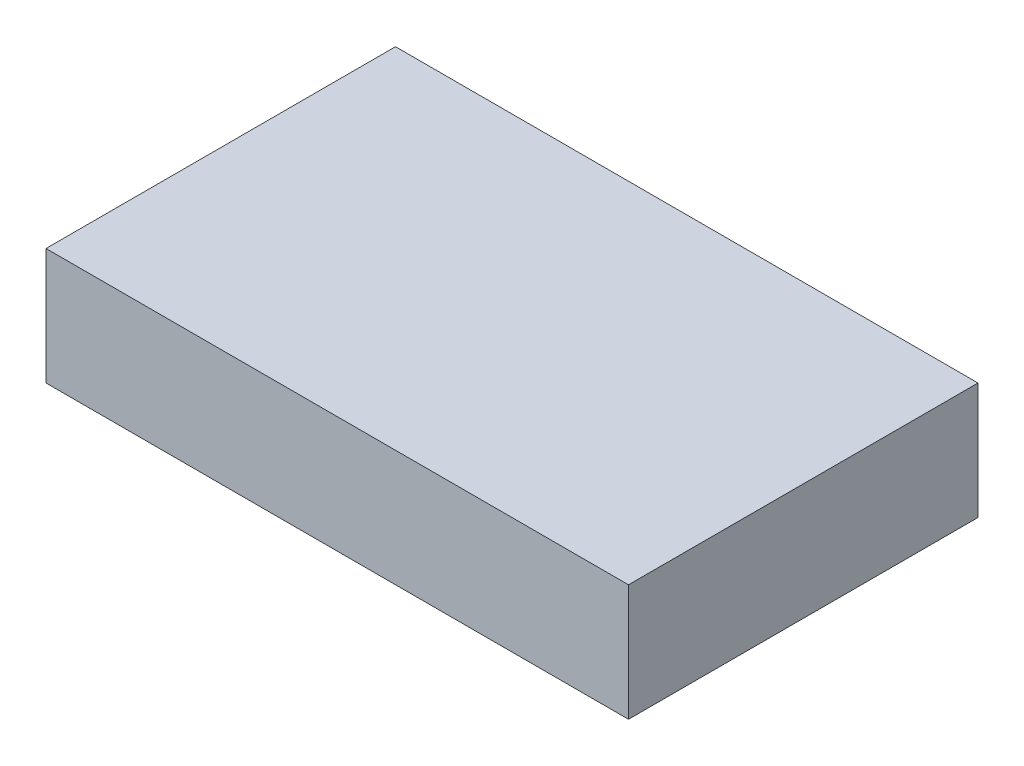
from build123d import *

# Parameters (mm, degrees)
SKETCH_1_W      = 50
SKETCH_1_H      = 30
EXTRUDE_1_DEPTH = 10


with BuildPart() as part:
    # Sketch 1 → Extrude 1 (new body)
    with BuildSketch(Plane(origin=(0, 0, 0), x_dir=(1, 0, 0), z_dir=(0, 1, 0))):
        Rectangle(SKETCH_1_W, SKETCH_1_H)
    extrude(amount=EXTRUDE_1_DEPTH)


solid = part.part
